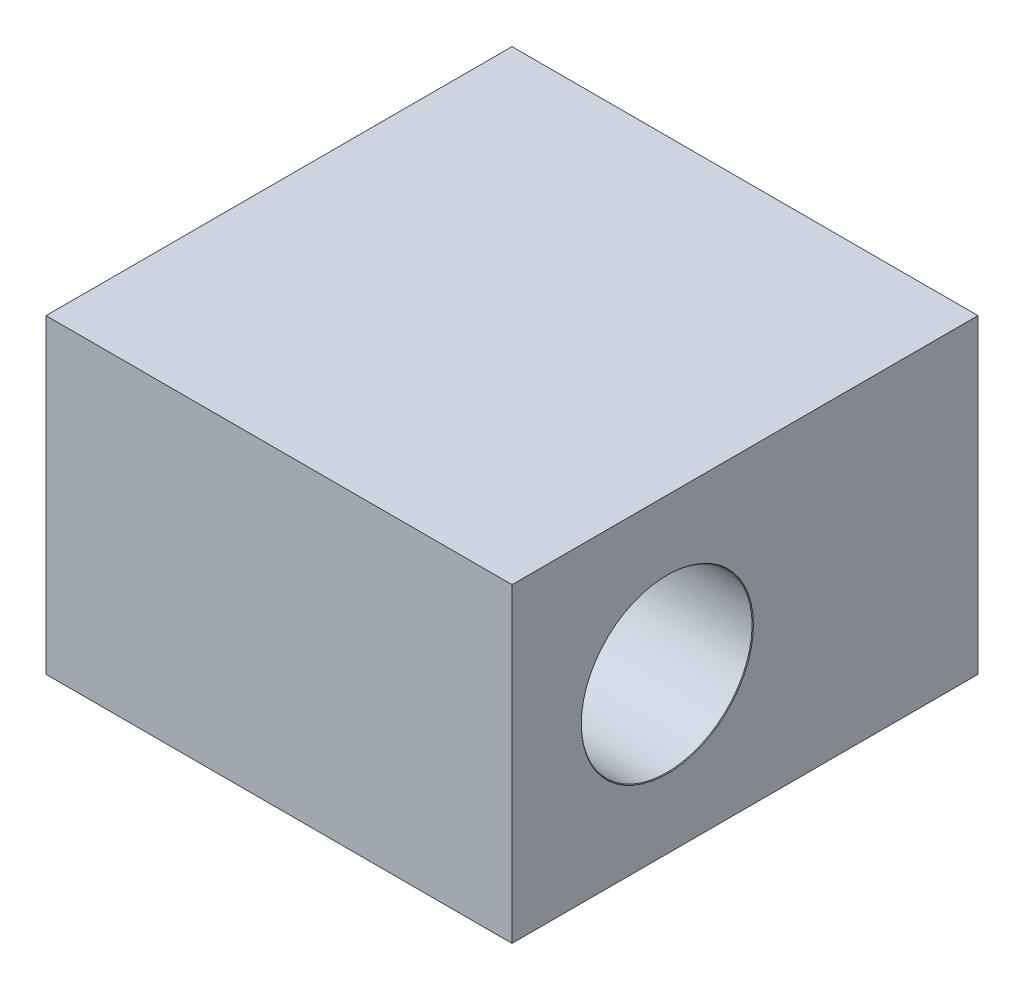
ISO-10303-21;
HEADER;
FILE_DESCRIPTION(('STEP AP214'),'2;1');
FILE_NAME('part.step','',(''),(''),'','','');
FILE_SCHEMA(('AUTOMOTIVE_DESIGN { 1 0 10303 214 1 1 1 1 }'));
ENDSEC;
DATA;
#1=APPLICATION_CONTEXT('core data for automotive mechanical design processes');
#2=APPLICATION_PROTOCOL_DEFINITION('international standard','automotive_design',2000,#1);
#3=PRODUCT_CONTEXT('',#1,'mechanical');
#4=PRODUCT('Part','Part','',(#3));
#5=PRODUCT_RELATED_PRODUCT_CATEGORY('part','',(#4));
#6=PRODUCT_DEFINITION_FORMATION('','',#4);
#7=PRODUCT_DEFINITION_CONTEXT('part definition',#1,'design');
#8=PRODUCT_DEFINITION('design','',#6,#7);
#9=PRODUCT_DEFINITION_SHAPE('','',#8);
#10=(LENGTH_UNIT() NAMED_UNIT(*) SI_UNIT(.MILLI.,.METRE.));
#11=(NAMED_UNIT(*) PLANE_ANGLE_UNIT() SI_UNIT($,.RADIAN.));
#12=(NAMED_UNIT(*) SI_UNIT($,.STERADIAN.) SOLID_ANGLE_UNIT());
#13=UNCERTAINTY_MEASURE_WITH_UNIT(LENGTH_MEASURE(1.E-05),#10,'distance_accuracy_value','');
#14=(GEOMETRIC_REPRESENTATION_CONTEXT(3) GLOBAL_UNCERTAINTY_ASSIGNED_CONTEXT((#13)) GLOBAL_UNIT_ASSIGNED_CONTEXT((#10,
#11,#12)) REPRESENTATION_CONTEXT('',''));
#15=CARTESIAN_POINT('',(0.,0.,0.));
#16=DIRECTION('',(0.,0.,1.));
#17=DIRECTION('',(1.,0.,0.));
#18=AXIS2_PLACEMENT_3D('',#15,#16,#17);
#19=CARTESIAN_POINT('',(-10.,54.,-18.));
#20=DIRECTION('',(1.,0.,0.));
#21=DIRECTION('',(0.,1.,0.));
#22=AXIS2_PLACEMENT_3D('',#19,#20,#21);
#23=PLANE('',#22);
#24=CARTESIAN_POINT('',(-10.,48.,-6.));
#25=DIRECTION('',(-1.,0.,0.));
#26=DIRECTION('',(0.,0.,1.));
#27=AXIS2_PLACEMENT_3D('',#24,#25,#26);
#28=CIRCLE('',#27,3.325);
#29=CARTESIAN_POINT('',(-10.,48.,-2.675));
#30=VERTEX_POINT('',#29);
#31=EDGE_CURVE('E149',#30,#30,#28,.T.);
#32=ORIENTED_EDGE('',*,*,#31,.T.);
#33=EDGE_LOOP('',(#32));
#34=FACE_BOUND('',#33,.T.);
#35=DIRECTION('',(0.,1.,0.));
#36=VECTOR('',#35,1.);
#37=CARTESIAN_POINT('',(-10.,54.,0.));
#38=LINE('',#37,#36);
#39=CARTESIAN_POINT('',(-10.,42.,0.));
#40=VERTEX_POINT('',#39);
#41=CARTESIAN_POINT('',(-10.,54.,0.));
#42=VERTEX_POINT('',#41);
#43=EDGE_CURVE('E81',#40,#42,#38,.T.);
#44=ORIENTED_EDGE('',*,*,#43,.F.);
#45=DIRECTION('',(0.,0.,1.));
#46=VECTOR('',#45,1.);
#47=CARTESIAN_POINT('',(-10.,42.,-18.));
#48=LINE('',#47,#46);
#49=CARTESIAN_POINT('',(-10.,42.,-18.));
#50=VERTEX_POINT('',#49);
#51=EDGE_CURVE('E11',#50,#40,#48,.T.);
#52=ORIENTED_EDGE('',*,*,#51,.F.);
#53=DIRECTION('',(0.,1.,0.));
#54=VECTOR('',#53,1.);
#55=CARTESIAN_POINT('',(-10.,54.,-18.));
#56=LINE('',#55,#54);
#57=CARTESIAN_POINT('',(-10.,54.,-18.));
#58=VERTEX_POINT('',#57);
#59=EDGE_CURVE('E74',#50,#58,#56,.T.);
#60=ORIENTED_EDGE('',*,*,#59,.T.);
#61=DIRECTION('',(0.,0.,1.));
#62=VECTOR('',#61,1.);
#63=CARTESIAN_POINT('',(-10.,54.,-18.));
#64=LINE('',#63,#62);
#65=EDGE_CURVE('E19',#58,#42,#64,.T.);
#66=ORIENTED_EDGE('',*,*,#65,.T.);
#67=EDGE_LOOP('',(#44,#52,#60,#66));
#68=FACE_BOUND('',#67,.T.);
#69=ADVANCED_FACE('F16',(#34,#68),#23,.T.);
#70=CARTESIAN_POINT('',(-10.,42.,-18.));
#71=DIRECTION('',(0.,-1.,0.));
#72=DIRECTION('',(1.,0.,0.));
#73=AXIS2_PLACEMENT_3D('',#70,#71,#72);
#74=PLANE('',#73);
#75=DIRECTION('',(1.,0.,0.));
#76=VECTOR('',#75,1.);
#77=CARTESIAN_POINT('',(-10.,42.,0.));
#78=LINE('',#77,#76);
#79=CARTESIAN_POINT('',(-28.,42.,0.));
#80=VERTEX_POINT('',#79);
#81=EDGE_CURVE('E76',#80,#40,#78,.T.);
#82=ORIENTED_EDGE('',*,*,#81,.F.);
#83=DIRECTION('',(0.,0.,1.));
#84=VECTOR('',#83,1.);
#85=CARTESIAN_POINT('',(-28.,42.,-18.));
#86=LINE('',#85,#84);
#87=CARTESIAN_POINT('',(-28.,42.,-18.));
#88=VERTEX_POINT('',#87);
#89=EDGE_CURVE('E25',#88,#80,#86,.T.);
#90=ORIENTED_EDGE('',*,*,#89,.F.);
#91=DIRECTION('',(1.,0.,0.));
#92=VECTOR('',#91,1.);
#93=CARTESIAN_POINT('',(-10.,42.,-18.));
#94=LINE('',#93,#92);
#95=EDGE_CURVE('E71',#88,#50,#94,.T.);
#96=ORIENTED_EDGE('',*,*,#95,.T.);
#97=ORIENTED_EDGE('',*,*,#51,.T.);
#98=EDGE_LOOP('',(#82,#90,#96,#97));
#99=FACE_BOUND('',#98,.T.);
#100=ADVANCED_FACE('F92',(#99),#74,.T.);
#101=CARTESIAN_POINT('',(-28.,54.,-18.));
#102=DIRECTION('',(-1.,0.,0.));
#103=DIRECTION('',(0.,0.,1.));
#104=AXIS2_PLACEMENT_3D('',#101,#102,#103);
#105=PLANE('',#104);
#106=CARTESIAN_POINT('',(-28.,48.,-6.));
#107=DIRECTION('',(-1.,0.,0.));
#108=DIRECTION('',(0.,0.,1.));
#109=AXIS2_PLACEMENT_3D('',#106,#107,#108);
#110=CIRCLE('',#109,5.525);
#111=CARTESIAN_POINT('',(-28.,48.,-0.475));
#112=VERTEX_POINT('',#111);
#113=EDGE_CURVE('E148',#112,#112,#110,.T.);
#114=ORIENTED_EDGE('',*,*,#113,.F.);
#115=EDGE_LOOP('',(#114));
#116=FACE_BOUND('',#115,.T.);
#117=DIRECTION('',(0.,-1.,0.));
#118=VECTOR('',#117,1.);
#119=CARTESIAN_POINT('',(-28.,54.,0.));
#120=LINE('',#119,#118);
#121=CARTESIAN_POINT('',(-28.,54.,0.));
#122=VERTEX_POINT('',#121);
#123=EDGE_CURVE('E66',#122,#80,#120,.T.);
#124=ORIENTED_EDGE('',*,*,#123,.F.);
#125=DIRECTION('',(0.,0.,1.));
#126=VECTOR('',#125,1.);
#127=CARTESIAN_POINT('',(-28.,54.,-18.));
#128=LINE('',#127,#126);
#129=CARTESIAN_POINT('',(-28.,54.,-18.));
#130=VERTEX_POINT('',#129);
#131=EDGE_CURVE('E61',#130,#122,#128,.T.);
#132=ORIENTED_EDGE('',*,*,#131,.F.);
#133=DIRECTION('',(0.,-1.,0.));
#134=VECTOR('',#133,1.);
#135=CARTESIAN_POINT('',(-28.,54.,-18.));
#136=LINE('',#135,#134);
#137=EDGE_CURVE('E64',#130,#88,#136,.T.);
#138=ORIENTED_EDGE('',*,*,#137,.T.);
#139=ORIENTED_EDGE('',*,*,#89,.T.);
#140=EDGE_LOOP('',(#124,#132,#138,#139));
#141=FACE_BOUND('',#140,.T.);
#142=ADVANCED_FACE('F63',(#116,#141),#105,.T.);
#143=CARTESIAN_POINT('',(-10.,54.,-18.));
#144=DIRECTION('',(0.,1.,0.));
#145=DIRECTION('',(0.,0.,1.));
#146=AXIS2_PLACEMENT_3D('',#143,#144,#145);
#147=PLANE('',#146);
#148=DIRECTION('',(-1.,0.,0.));
#149=VECTOR('',#148,1.);
#150=CARTESIAN_POINT('',(-10.,54.,0.));
#151=LINE('',#150,#149);
#152=EDGE_CURVE('E84',#42,#122,#151,.T.);
#153=ORIENTED_EDGE('',*,*,#152,.F.);
#154=ORIENTED_EDGE('',*,*,#65,.F.);
#155=DIRECTION('',(-1.,0.,0.));
#156=VECTOR('',#155,1.);
#157=CARTESIAN_POINT('',(-10.,54.,-18.));
#158=LINE('',#157,#156);
#159=EDGE_CURVE('E70',#58,#130,#158,.T.);
#160=ORIENTED_EDGE('',*,*,#159,.T.);
#161=ORIENTED_EDGE('',*,*,#131,.T.);
#162=EDGE_LOOP('',(#153,#154,#160,#161));
#163=FACE_BOUND('',#162,.T.);
#164=ADVANCED_FACE('F73',(#163),#147,.T.);
#165=CARTESIAN_POINT('',(0.,0.,-18.));
#166=DIRECTION('',(0.,0.,-1.));
#167=DIRECTION('',(-1.,0.,0.));
#168=AXIS2_PLACEMENT_3D('',#165,#166,#167);
#169=PLANE('',#168);
#170=ORIENTED_EDGE('',*,*,#59,.F.);
#171=ORIENTED_EDGE('',*,*,#95,.F.);
#172=ORIENTED_EDGE('',*,*,#137,.F.);
#173=ORIENTED_EDGE('',*,*,#159,.F.);
#174=EDGE_LOOP('',(#170,#171,#172,#173));
#175=FACE_BOUND('',#174,.T.);
#176=ADVANCED_FACE('F69',(#175),#169,.T.);
#177=CARTESIAN_POINT('',(0.,0.,0.));
#178=DIRECTION('',(0.,0.,-1.));
#179=DIRECTION('',(-1.,0.,0.));
#180=AXIS2_PLACEMENT_3D('',#177,#178,#179);
#181=PLANE('',#180);
#182=ORIENTED_EDGE('',*,*,#43,.T.);
#183=ORIENTED_EDGE('',*,*,#152,.T.);
#184=ORIENTED_EDGE('',*,*,#123,.T.);
#185=ORIENTED_EDGE('',*,*,#81,.T.);
#186=EDGE_LOOP('',(#182,#183,#184,#185));
#187=FACE_BOUND('',#186,.T.);
#188=ADVANCED_FACE('F91',(#187),#181,.F.);
#189=CARTESIAN_POINT('',(-10.025,48.,-6.));
#190=DIRECTION('',(1.,0.,0.));
#191=DIRECTION('',(0.,0.,-1.));
#192=AXIS2_PLACEMENT_3D('',#189,#190,#191);
#193=CONICAL_SURFACE('',#192,3.3,0.785398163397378);
#194=ORIENTED_EDGE('',*,*,#31,.F.);
#195=EDGE_LOOP('',(#194));
#196=FACE_BOUND('',#195,.T.);
#197=CARTESIAN_POINT('',(-10.025,48.,-6.));
#198=DIRECTION('',(-1.,0.,0.));
#199=DIRECTION('',(0.,0.,1.));
#200=AXIS2_PLACEMENT_3D('',#197,#198,#199);
#201=CIRCLE('',#200,3.3);
#202=CARTESIAN_POINT('',(-10.025,48.,-2.7));
#203=VERTEX_POINT('',#202);
#204=EDGE_CURVE('E85',#203,#203,#201,.T.);
#205=ORIENTED_EDGE('',*,*,#204,.T.);
#206=EDGE_LOOP('',(#205));
#207=FACE_BOUND('',#206,.T.);
#208=ADVANCED_FACE('F115',(#196,#207),#193,.F.);
#209=CARTESIAN_POINT('',(-28.,48.,-6.));
#210=DIRECTION('',(-1.,0.,0.));
#211=DIRECTION('',(0.,0.,1.));
#212=AXIS2_PLACEMENT_3D('',#209,#210,#211);
#213=CYLINDRICAL_SURFACE('',#212,3.3);
#214=ORIENTED_EDGE('',*,*,#204,.F.);
#215=EDGE_LOOP('',(#214));
#216=FACE_BOUND('',#215,.T.);
#217=CARTESIAN_POINT('',(-21.175,48.,-6.));
#218=DIRECTION('',(-1.,0.,0.));
#219=DIRECTION('',(0.,0.,1.));
#220=AXIS2_PLACEMENT_3D('',#217,#218,#219);
#221=CIRCLE('',#220,3.3);
#222=CARTESIAN_POINT('',(-21.175,48.,-2.7));
#223=VERTEX_POINT('',#222);
#224=EDGE_CURVE('E161',#223,#223,#221,.T.);
#225=ORIENTED_EDGE('',*,*,#224,.T.);
#226=EDGE_LOOP('',(#225));
#227=FACE_BOUND('',#226,.T.);
#228=ADVANCED_FACE('F119',(#216,#227),#213,.F.);
#229=CARTESIAN_POINT('',(-21.2,48.,-6.));
#230=DIRECTION('',(-1.,0.,0.));
#231=DIRECTION('',(0.,0.,1.));
#232=AXIS2_PLACEMENT_3D('',#229,#230,#231);
#233=CONICAL_SURFACE('',#232,3.325,0.785398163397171);
#234=ORIENTED_EDGE('',*,*,#224,.F.);
#235=EDGE_LOOP('',(#234));
#236=FACE_BOUND('',#235,.T.);
#237=CARTESIAN_POINT('',(-21.2,48.,-6.));
#238=DIRECTION('',(-1.,0.,0.));
#239=DIRECTION('',(0.,0.,1.));
#240=AXIS2_PLACEMENT_3D('',#237,#238,#239);
#241=CIRCLE('',#240,3.325);
#242=CARTESIAN_POINT('',(-21.2,48.,-2.675));
#243=VERTEX_POINT('',#242);
#244=EDGE_CURVE('E158',#243,#243,#241,.T.);
#245=ORIENTED_EDGE('',*,*,#244,.T.);
#246=EDGE_LOOP('',(#245));
#247=FACE_BOUND('',#246,.T.);
#248=ADVANCED_FACE('F123',(#236,#247),#233,.F.);
#249=CARTESIAN_POINT('',(-21.2,51.325,-6.));
#250=DIRECTION('',(1.,0.,0.));
#251=DIRECTION('',(0.,0.,-1.));
#252=AXIS2_PLACEMENT_3D('',#249,#250,#251);
#253=PLANE('',#252);
#254=ORIENTED_EDGE('',*,*,#244,.F.);
#255=EDGE_LOOP('',(#254));
#256=FACE_BOUND('',#255,.T.);
#257=CARTESIAN_POINT('',(-21.2,48.,-6.));
#258=DIRECTION('',(-1.,0.,0.));
#259=DIRECTION('',(0.,0.,1.));
#260=AXIS2_PLACEMENT_3D('',#257,#258,#259);
#261=CIRCLE('',#260,5.5);
#262=CARTESIAN_POINT('',(-21.2,48.,-0.5));
#263=VERTEX_POINT('',#262);
#264=EDGE_CURVE('E151',#263,#263,#261,.T.);
#265=ORIENTED_EDGE('',*,*,#264,.T.);
#266=EDGE_LOOP('',(#265));
#267=FACE_BOUND('',#266,.T.);
#268=ADVANCED_FACE('F127',(#256,#267),#253,.F.);
#269=CARTESIAN_POINT('',(-28.,48.,-6.));
#270=DIRECTION('',(-1.,0.,0.));
#271=DIRECTION('',(0.,0.,1.));
#272=AXIS2_PLACEMENT_3D('',#269,#270,#271);
#273=CYLINDRICAL_SURFACE('',#272,5.5);
#274=ORIENTED_EDGE('',*,*,#264,.F.);
#275=EDGE_LOOP('',(#274));
#276=FACE_BOUND('',#275,.T.);
#277=CARTESIAN_POINT('',(-27.975,48.,-6.));
#278=DIRECTION('',(-1.,0.,0.));
#279=DIRECTION('',(0.,0.,1.));
#280=AXIS2_PLACEMENT_3D('',#277,#278,#279);
#281=CIRCLE('',#280,5.5);
#282=CARTESIAN_POINT('',(-27.975,48.,-0.5));
#283=VERTEX_POINT('',#282);
#284=EDGE_CURVE('E145',#283,#283,#281,.T.);
#285=ORIENTED_EDGE('',*,*,#284,.T.);
#286=EDGE_LOOP('',(#285));
#287=FACE_BOUND('',#286,.T.);
#288=ADVANCED_FACE('F131',(#276,#287),#273,.F.);
#289=CARTESIAN_POINT('',(-28.,48.,-6.));
#290=DIRECTION('',(-1.,0.,0.));
#291=DIRECTION('',(0.,0.,1.));
#292=AXIS2_PLACEMENT_3D('',#289,#290,#291);
#293=CONICAL_SURFACE('',#292,5.525,0.785398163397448);
#294=ORIENTED_EDGE('',*,*,#284,.F.);
#295=EDGE_LOOP('',(#294));
#296=FACE_BOUND('',#295,.T.);
#297=ORIENTED_EDGE('',*,*,#113,.T.);
#298=EDGE_LOOP('',(#297));
#299=FACE_BOUND('',#298,.T.);
#300=ADVANCED_FACE('F135',(#296,#299),#293,.F.);
#301=CLOSED_SHELL('',(#69,#100,#142,#164,#176,#188,#208,#228,#248,#268,#288,#300));
#302=MANIFOLD_SOLID_BREP('B1',#301);
#303=ADVANCED_BREP_SHAPE_REPRESENTATION('',(#18,#302),#14);
#304=SHAPE_DEFINITION_REPRESENTATION(#9,#303);
ENDSEC;
END-ISO-10303-21;
